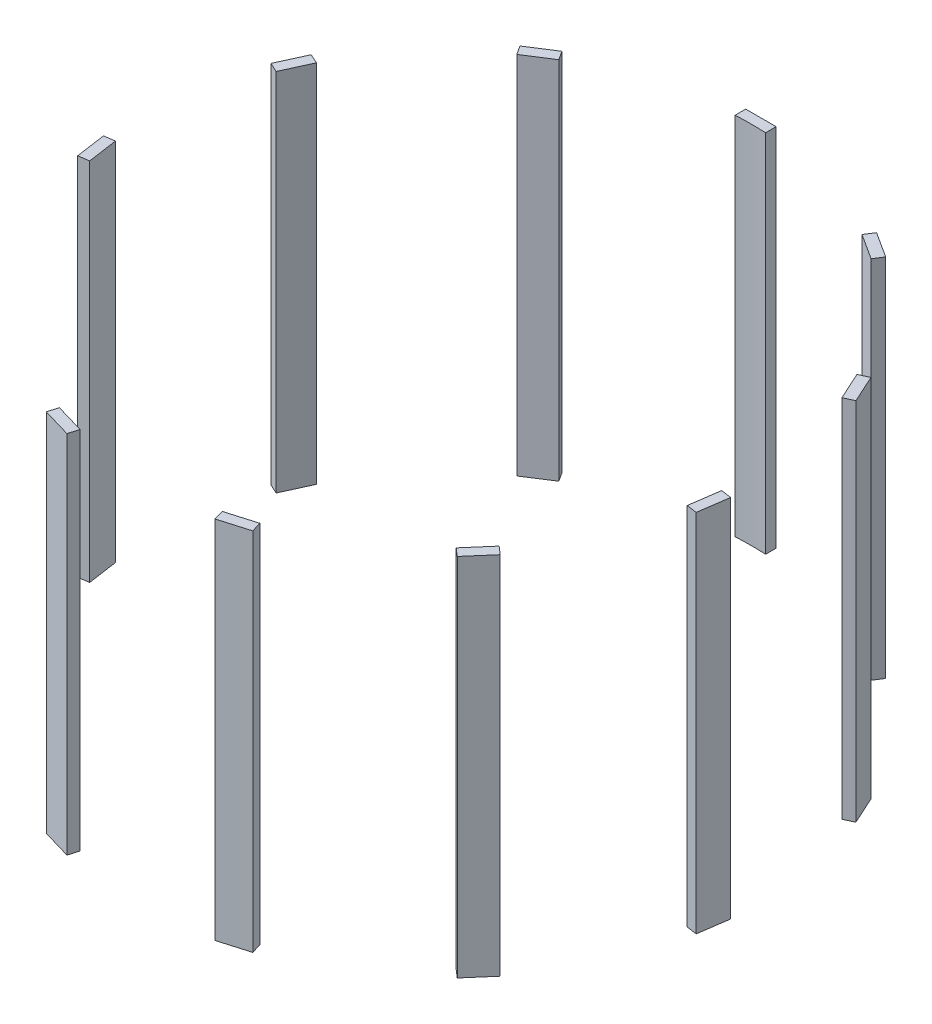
from build123d import *

# Parameters (mm, degrees)
BOSS_EXTRUDE1_DEPTH    = 114.3
BOSS_EXTRUDE1_2_DEPTH  = 114.3
BOSS_EXTRUDE1_3_DEPTH  = 114.3
BOSS_EXTRUDE1_4_DEPTH  = 114.3
BOSS_EXTRUDE1_5_DEPTH  = 114.3
BOSS_EXTRUDE1_6_DEPTH  = 114.3
BOSS_EXTRUDE1_7_DEPTH  = 114.3
BOSS_EXTRUDE1_8_DEPTH  = 114.3
BOSS_EXTRUDE1_9_DEPTH  = 114.3
BOSS_EXTRUDE1_10_DEPTH = 114.3


with BuildPart() as part:
    # Sketch2 → Boss-Extrude1 (new body)
    with BuildSketch(Plane(origin=(0, 0, 0), x_dir=(1, 0, 0), z_dir=(0, 1, 0))):
        with BuildLine():
            ThreePointArc((-4.826, 95.12766277), (-0.063579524, 95.24997878), (4.699, 95.134020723))
            Line((4.699, 95.134020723), (4.699, 98.436020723))
            Line((4.699, 98.436020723), (-4.826, 98.436020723))
            Line((-4.826, 98.436020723), (-4.826, 95.12766277))
        make_face()
    extrude(amount=BOSS_EXTRUDE1_DEPTH)


with BuildPart() as body_2:
    # Sketch2 → Boss-Extrude1 2 (new body)
    with BuildSketch(Plane(origin=(0, 0, 0), x_dir=(1, 0, 0), z_dir=(0, 1, 0))):
        Polygon((47.370007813, 82.63561496), (55.386385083, 77.491359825), (57.171581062, 80.26917899), (49.158641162, 85.418782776), align=None)
    extrude(amount=BOSS_EXTRUDE1_2_DEPTH)


with BuildPart() as body_3:
    # Sketch2 → Boss-Extrude1 3 (new body)
    with BuildSketch(Plane(origin=(0, 0, 0), x_dir=(1, 0, 0), z_dir=(0, 1, 0))):
        Polygon((-57.27842026, 80.200517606), (-55.489786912, 77.41734979), (-47.480284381, 82.572302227), (-49.26548036, 85.350121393), align=None)
    extrude(amount=BOSS_EXTRUDE1_3_DEPTH)


with BuildPart() as body_4:
    # Sketch2 → Boss-Extrude1 4 (new body)
    with BuildSketch(Plane(origin=(0, 0, 0), x_dir=(1, 0, 0), z_dir=(0, 1, 0))):
        Polygon((84.526372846, 43.907343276), (88.488984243, 35.24573971), (91.492589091, 36.617440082), (87.535761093, 45.281684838), align=None)
    extrude(amount=BOSS_EXTRUDE1_4_DEPTH)


with BuildPart() as body_5:
    # Sketch2 → Boss-Extrude1 5 (new body)
    with BuildSketch(Plane(origin=(0, 0, 0), x_dir=(1, 0, 0), z_dir=(0, 1, 0))):
        Polygon((-91.545346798, 36.501916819), (-88.535958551, 35.127575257), (-84.584913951, 43.794461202), (-87.588518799, 45.166161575), align=None)
    extrude(amount=BOSS_EXTRUDE1_5_DEPTH)


with BuildPart() as body_6:
    # Sketch2 → Boss-Extrude1 6 (new body)
    with BuildSketch(Plane(origin=(0, 0, 0), x_dir=(1, 0, 0), z_dir=(0, 1, 0))):
        Polygon((-96.747272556, -18.785784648), (-93.472588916, -18.314956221), (-94.834430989, -8.887811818), (-98.10282139, -9.357735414), align=None)
    extrude(amount=BOSS_EXTRUDE1_6_DEPTH)


with BuildPart() as body_7:
    # Sketch2 → Boss-Extrude1 7 (new body)
    with BuildSketch(Plane(origin=(0, 0, 0), x_dir=(1, 0, 0), z_dir=(0, 1, 0))):
        Polygon((94.846211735, -8.761199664), (93.496956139, -18.190153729), (96.76534654, -18.660077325), (98.120895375, -9.232028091), align=None)
    extrude(amount=BOSS_EXTRUDE1_7_DEPTH)


with BuildPart() as body_8:
    # Sketch2 → Boss-Extrude1 8 (new body)
    with BuildSketch(Plane(origin=(0, 0, 0), x_dir=(1, 0, 0), z_dir=(0, 1, 0))):
        Polygon((75.053048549, -58.648123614), (68.82030508, -65.850801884), (71.315790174, -68.013152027), (77.553338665, -60.814637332), align=None)
    extrude(amount=BOSS_EXTRUDE1_8_DEPTH)


with BuildPart() as body_9:
    # Sketch2 → Boss-Extrude1 9 (new body)
    with BuildSketch(Plane(origin=(0, 0, 0), x_dir=(1, 0, 0), z_dir=(0, 1, 0))):
        Polygon((31.431072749, -89.914682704), (22.293693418, -92.60428572), (23.223974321, -95.772531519), (32.363144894, -93.089028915), align=None)
    extrude(amount=BOSS_EXTRUDE1_9_DEPTH)


with BuildPart() as body_10:
    # Sketch2 → Boss-Extrude1 10 (new body)
    with BuildSketch(Plane(origin=(0, 0, 0), x_dir=(1, 0, 0), z_dir=(0, 1, 0))):
        Polygon((-23.102118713, -95.808311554), (-22.170046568, -92.633965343), (-31.311008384, -89.956563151), (-32.241289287, -93.12480895), align=None)
    extrude(amount=BOSS_EXTRUDE1_10_DEPTH)


solid = Compound([part.part, body_2.part, body_3.part, body_4.part, body_5.part, body_6.part, body_7.part, body_8.part, body_9.part, body_10.part])
